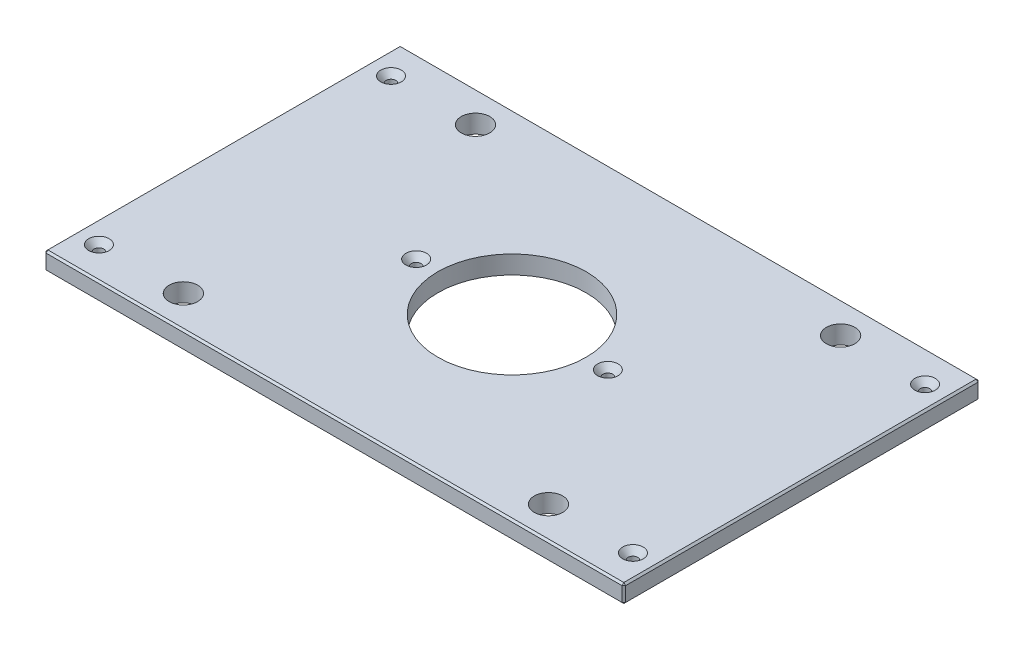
ISO-10303-21;
HEADER;
FILE_DESCRIPTION(('STEP AP214'),'2;1');
FILE_NAME('part.step','',(''),(''),'','','');
FILE_SCHEMA(('AUTOMOTIVE_DESIGN { 1 0 10303 214 1 1 1 1 }'));
ENDSEC;
DATA;
#1=APPLICATION_CONTEXT('core data for automotive mechanical design processes');
#2=APPLICATION_PROTOCOL_DEFINITION('international standard','automotive_design',2000,#1);
#3=PRODUCT_CONTEXT('',#1,'mechanical');
#4=PRODUCT('Part','Part','',(#3));
#5=PRODUCT_RELATED_PRODUCT_CATEGORY('part','',(#4));
#6=PRODUCT_DEFINITION_FORMATION('','',#4);
#7=PRODUCT_DEFINITION_CONTEXT('part definition',#1,'design');
#8=PRODUCT_DEFINITION('design','',#6,#7);
#9=PRODUCT_DEFINITION_SHAPE('','',#8);
#10=(LENGTH_UNIT() NAMED_UNIT(*) SI_UNIT(.MILLI.,.METRE.));
#11=(NAMED_UNIT(*) PLANE_ANGLE_UNIT() SI_UNIT($,.RADIAN.));
#12=(NAMED_UNIT(*) SI_UNIT($,.STERADIAN.) SOLID_ANGLE_UNIT());
#13=UNCERTAINTY_MEASURE_WITH_UNIT(LENGTH_MEASURE(1.E-05),#10,'distance_accuracy_value','');
#14=(GEOMETRIC_REPRESENTATION_CONTEXT(3) GLOBAL_UNCERTAINTY_ASSIGNED_CONTEXT((#13)) GLOBAL_UNIT_ASSIGNED_CONTEXT((#10,
#11,#12)) REPRESENTATION_CONTEXT('',''));
#15=CARTESIAN_POINT('',(0.,0.,0.));
#16=DIRECTION('',(0.,0.,1.));
#17=DIRECTION('',(1.,0.,0.));
#18=AXIS2_PLACEMENT_3D('',#15,#16,#17);
#19=CARTESIAN_POINT('',(-201.6125,12.7,-123.825));
#20=DIRECTION('',(1.,0.,0.));
#21=DIRECTION('',(0.,0.,-1.));
#22=AXIS2_PLACEMENT_3D('',#19,#20,#21);
#23=PLANE('',#22);
#24=DIRECTION('',(0.,0.,-1.));
#25=VECTOR('',#24,1.);
#26=CARTESIAN_POINT('',(-201.6125,11.4300000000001,-123.825));
#27=LINE('',#26,#25);
#28=CARTESIAN_POINT('',(-201.6125,11.4300000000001,122.555));
#29=VERTEX_POINT('',#28);
#30=CARTESIAN_POINT('',(-201.6125,11.4300000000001,-122.555));
#31=VERTEX_POINT('',#30);
#32=EDGE_CURVE('E136',#29,#31,#27,.T.);
#33=ORIENTED_EDGE('',*,*,#32,.T.);
#34=DIRECTION('',(0.,-1.,0.));
#35=VECTOR('',#34,1.);
#36=CARTESIAN_POINT('',(-201.6125,12.7,-122.555));
#37=LINE('',#36,#35);
#38=CARTESIAN_POINT('',(-201.6125,1.26999999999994,-122.555));
#39=VERTEX_POINT('',#38);
#40=EDGE_CURVE('E132',#31,#39,#37,.T.);
#41=ORIENTED_EDGE('',*,*,#40,.T.);
#42=DIRECTION('',(0.,0.,1.));
#43=VECTOR('',#42,1.);
#44=CARTESIAN_POINT('',(-201.6125,1.26999999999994,-123.825));
#45=LINE('',#44,#43);
#46=CARTESIAN_POINT('',(-201.6125,1.26999999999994,122.555));
#47=VERTEX_POINT('',#46);
#48=EDGE_CURVE('E127',#39,#47,#45,.T.);
#49=ORIENTED_EDGE('',*,*,#48,.T.);
#50=DIRECTION('',(0.,1.,0.));
#51=VECTOR('',#50,1.);
#52=CARTESIAN_POINT('',(-201.6125,12.7,122.555));
#53=LINE('',#52,#51);
#54=EDGE_CURVE('E129',#47,#29,#53,.T.);
#55=ORIENTED_EDGE('',*,*,#54,.T.);
#56=EDGE_LOOP('',(#33,#41,#49,#55));
#57=FACE_BOUND('',#56,.T.);
#58=ADVANCED_FACE('F36',(#57),#23,.F.);
#59=CARTESIAN_POINT('',(-201.6125,12.7,123.825));
#60=DIRECTION('',(0.,0.,-1.));
#61=DIRECTION('',(-1.,0.,0.));
#62=AXIS2_PLACEMENT_3D('',#59,#60,#61);
#63=PLANE('',#62);
#64=DIRECTION('',(1.,0.,0.));
#65=VECTOR('',#64,1.);
#66=CARTESIAN_POINT('',(-201.6125,1.26999999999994,123.825));
#67=LINE('',#66,#65);
#68=CARTESIAN_POINT('',(-200.3425,1.26999999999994,123.825));
#69=VERTEX_POINT('',#68);
#70=CARTESIAN_POINT('',(200.3425,1.26999999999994,123.825));
#71=VERTEX_POINT('',#70);
#72=EDGE_CURVE('E59',#69,#71,#67,.T.);
#73=ORIENTED_EDGE('',*,*,#72,.T.);
#74=DIRECTION('',(0.,1.,0.));
#75=VECTOR('',#74,1.);
#76=CARTESIAN_POINT('',(200.3425,12.7,123.825));
#77=LINE('',#76,#75);
#78=CARTESIAN_POINT('',(200.3425,11.4300000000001,123.825));
#79=VERTEX_POINT('',#78);
#80=EDGE_CURVE('E11',#71,#79,#77,.T.);
#81=ORIENTED_EDGE('',*,*,#80,.T.);
#82=DIRECTION('',(-1.,0.,0.));
#83=VECTOR('',#82,1.);
#84=CARTESIAN_POINT('',(-201.6125,11.4300000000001,123.825));
#85=LINE('',#84,#83);
#86=CARTESIAN_POINT('',(-200.3425,11.4300000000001,123.825));
#87=VERTEX_POINT('',#86);
#88=EDGE_CURVE('E45',#79,#87,#85,.T.);
#89=ORIENTED_EDGE('',*,*,#88,.T.);
#90=DIRECTION('',(0.,-1.,0.));
#91=VECTOR('',#90,1.);
#92=CARTESIAN_POINT('',(-200.3425,12.7,123.825));
#93=LINE('',#92,#91);
#94=EDGE_CURVE('E280',#87,#69,#93,.T.);
#95=ORIENTED_EDGE('',*,*,#94,.T.);
#96=EDGE_LOOP('',(#73,#81,#89,#95));
#97=FACE_BOUND('',#96,.T.);
#98=ADVANCED_FACE('F349',(#97),#63,.F.);
#99=CARTESIAN_POINT('',(201.6125,12.7,-123.825));
#100=DIRECTION('',(-1.,0.,0.));
#101=DIRECTION('',(0.,0.,1.));
#102=AXIS2_PLACEMENT_3D('',#99,#100,#101);
#103=PLANE('',#102);
#104=DIRECTION('',(0.,0.,-1.));
#105=VECTOR('',#104,1.);
#106=CARTESIAN_POINT('',(201.6125,1.26999999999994,-123.825));
#107=LINE('',#106,#105);
#108=CARTESIAN_POINT('',(201.6125,1.26999999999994,122.555));
#109=VERTEX_POINT('',#108);
#110=CARTESIAN_POINT('',(201.6125,1.26999999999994,-122.555));
#111=VERTEX_POINT('',#110);
#112=EDGE_CURVE('E275',#109,#111,#107,.T.);
#113=ORIENTED_EDGE('',*,*,#112,.T.);
#114=DIRECTION('',(0.,1.,0.));
#115=VECTOR('',#114,1.);
#116=CARTESIAN_POINT('',(201.6125,12.7,-122.555));
#117=LINE('',#116,#115);
#118=CARTESIAN_POINT('',(201.6125,11.4300000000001,-122.555));
#119=VERTEX_POINT('',#118);
#120=EDGE_CURVE('E277',#111,#119,#117,.T.);
#121=ORIENTED_EDGE('',*,*,#120,.T.);
#122=DIRECTION('',(0.,0.,1.));
#123=VECTOR('',#122,1.);
#124=CARTESIAN_POINT('',(201.6125,11.4300000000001,123.825));
#125=LINE('',#124,#123);
#126=CARTESIAN_POINT('',(201.6125,11.4300000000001,122.555));
#127=VERTEX_POINT('',#126);
#128=EDGE_CURVE('E273',#119,#127,#125,.T.);
#129=ORIENTED_EDGE('',*,*,#128,.T.);
#130=DIRECTION('',(0.,-1.,0.));
#131=VECTOR('',#130,1.);
#132=CARTESIAN_POINT('',(201.6125,12.7,122.555));
#133=LINE('',#132,#131);
#134=EDGE_CURVE('E271',#127,#109,#133,.T.);
#135=ORIENTED_EDGE('',*,*,#134,.T.);
#136=EDGE_LOOP('',(#113,#121,#129,#135));
#137=FACE_BOUND('',#136,.T.);
#138=ADVANCED_FACE('F336',(#137),#103,.F.);
#139=CARTESIAN_POINT('',(-201.6125,12.7,-123.825));
#140=DIRECTION('',(0.,0.,1.));
#141=DIRECTION('',(1.,0.,0.));
#142=AXIS2_PLACEMENT_3D('',#139,#140,#141);
#143=PLANE('',#142);
#144=DIRECTION('',(-1.,0.,0.));
#145=VECTOR('',#144,1.);
#146=CARTESIAN_POINT('',(-201.6125,1.26999999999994,-123.825));
#147=LINE('',#146,#145);
#148=CARTESIAN_POINT('',(200.3425,1.26999999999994,-123.825));
#149=VERTEX_POINT('',#148);
#150=CARTESIAN_POINT('',(-200.3425,1.26999999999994,-123.825));
#151=VERTEX_POINT('',#150);
#152=EDGE_CURVE('E247',#149,#151,#147,.T.);
#153=ORIENTED_EDGE('',*,*,#152,.T.);
#154=DIRECTION('',(0.,1.,0.));
#155=VECTOR('',#154,1.);
#156=CARTESIAN_POINT('',(-200.3425,12.7,-123.825));
#157=LINE('',#156,#155);
#158=CARTESIAN_POINT('',(-200.3425,11.4300000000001,-123.825));
#159=VERTEX_POINT('',#158);
#160=EDGE_CURVE('E251',#151,#159,#157,.T.);
#161=ORIENTED_EDGE('',*,*,#160,.T.);
#162=DIRECTION('',(1.,0.,0.));
#163=VECTOR('',#162,1.);
#164=CARTESIAN_POINT('',(201.6125,11.4300000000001,-123.825));
#165=LINE('',#164,#163);
#166=CARTESIAN_POINT('',(200.3425,11.4300000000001,-123.825));
#167=VERTEX_POINT('',#166);
#168=EDGE_CURVE('E249',#159,#167,#165,.T.);
#169=ORIENTED_EDGE('',*,*,#168,.T.);
#170=DIRECTION('',(0.,-1.,0.));
#171=VECTOR('',#170,1.);
#172=CARTESIAN_POINT('',(200.3425,12.7,-123.825));
#173=LINE('',#172,#171);
#174=EDGE_CURVE('E245',#167,#149,#173,.T.);
#175=ORIENTED_EDGE('',*,*,#174,.T.);
#176=EDGE_LOOP('',(#153,#161,#169,#175));
#177=FACE_BOUND('',#176,.T.);
#178=ADVANCED_FACE('F310',(#177),#143,.F.);
#179=CARTESIAN_POINT('',(0.,12.7,0.));
#180=DIRECTION('',(0.,1.,0.));
#181=DIRECTION('',(0.,0.,1.));
#182=AXIS2_PLACEMENT_3D('',#179,#180,#181);
#183=PLANE('',#182);
#184=CARTESIAN_POINT('',(185.7375,12.7,-101.6));
#185=DIRECTION('',(0.,1.,0.));
#186=DIRECTION('',(0.,0.,1.));
#187=AXIS2_PLACEMENT_3D('',#184,#185,#186);
#188=CIRCLE('',#187,7.13739999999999);
#189=CARTESIAN_POINT('',(185.7375,12.7,-94.4626));
#190=VERTEX_POINT('',#189);
#191=EDGE_CURVE('E753',#190,#190,#188,.T.);
#192=ORIENTED_EDGE('',*,*,#191,.F.);
#193=EDGE_LOOP('',(#192));
#194=FACE_BOUND('',#193,.T.);
#195=CARTESIAN_POINT('',(185.7375,12.7,101.6));
#196=DIRECTION('',(0.,1.,0.));
#197=DIRECTION('',(0.,0.,1.));
#198=AXIS2_PLACEMENT_3D('',#195,#196,#197);
#199=CIRCLE('',#198,7.13739999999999);
#200=CARTESIAN_POINT('',(185.7375,12.7,108.7374));
#201=VERTEX_POINT('',#200);
#202=EDGE_CURVE('E757',#201,#201,#199,.T.);
#203=ORIENTED_EDGE('',*,*,#202,.F.);
#204=EDGE_LOOP('',(#203));
#205=FACE_BOUND('',#204,.T.);
#206=CARTESIAN_POINT('',(-185.7375,12.7,101.6));
#207=DIRECTION('',(0.,1.,0.));
#208=DIRECTION('',(0.,0.,1.));
#209=AXIS2_PLACEMENT_3D('',#206,#207,#208);
#210=CIRCLE('',#209,7.13739999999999);
#211=CARTESIAN_POINT('',(-185.7375,12.7,108.7374));
#212=VERTEX_POINT('',#211);
#213=EDGE_CURVE('E761',#212,#212,#210,.T.);
#214=ORIENTED_EDGE('',*,*,#213,.F.);
#215=EDGE_LOOP('',(#214));
#216=FACE_BOUND('',#215,.T.);
#217=CARTESIAN_POINT('',(-66.675,12.7,0.));
#218=DIRECTION('',(0.,1.,0.));
#219=DIRECTION('',(0.,0.,1.));
#220=AXIS2_PLACEMENT_3D('',#217,#218,#219);
#221=CIRCLE('',#220,7.1374);
#222=CARTESIAN_POINT('',(-66.675,12.7,7.1374));
#223=VERTEX_POINT('',#222);
#224=EDGE_CURVE('E765',#223,#223,#221,.T.);
#225=ORIENTED_EDGE('',*,*,#224,.F.);
#226=EDGE_LOOP('',(#225));
#227=FACE_BOUND('',#226,.T.);
#228=CARTESIAN_POINT('',(66.675,12.7,0.));
#229=DIRECTION('',(0.,1.,0.));
#230=DIRECTION('',(0.,0.,1.));
#231=AXIS2_PLACEMENT_3D('',#228,#229,#230);
#232=CIRCLE('',#231,7.1374);
#233=CARTESIAN_POINT('',(66.675,12.7,7.1374));
#234=VERTEX_POINT('',#233);
#235=EDGE_CURVE('E769',#234,#234,#232,.T.);
#236=ORIENTED_EDGE('',*,*,#235,.F.);
#237=EDGE_LOOP('',(#236));
#238=FACE_BOUND('',#237,.T.);
#239=CARTESIAN_POINT('',(-185.7375,12.7,-101.6));
#240=DIRECTION('',(0.,1.,0.));
#241=DIRECTION('',(0.,0.,1.));
#242=AXIS2_PLACEMENT_3D('',#239,#240,#241);
#243=CIRCLE('',#242,7.13739999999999);
#244=CARTESIAN_POINT('',(-185.7375,12.7,-94.4626));
#245=VERTEX_POINT('',#244);
#246=EDGE_CURVE('E772',#245,#245,#243,.T.);
#247=ORIENTED_EDGE('',*,*,#246,.F.);
#248=EDGE_LOOP('',(#247));
#249=FACE_BOUND('',#248,.T.);
#250=DIRECTION('',(0.,0.,-1.));
#251=VECTOR('',#250,1.);
#252=CARTESIAN_POINT('',(200.3425,12.7,-123.825));
#253=LINE('',#252,#251);
#254=CARTESIAN_POINT('',(200.3425,12.7,122.555));
#255=VERTEX_POINT('',#254);
#256=CARTESIAN_POINT('',(200.3425,12.7,-122.555));
#257=VERTEX_POINT('',#256);
#258=EDGE_CURVE('E258',#255,#257,#253,.T.);
#259=ORIENTED_EDGE('',*,*,#258,.T.);
#260=DIRECTION('',(-1.,0.,0.));
#261=VECTOR('',#260,1.);
#262=CARTESIAN_POINT('',(-201.6125,12.7,-122.555));
#263=LINE('',#262,#261);
#264=CARTESIAN_POINT('',(-200.3425,12.7,-122.555));
#265=VERTEX_POINT('',#264);
#266=EDGE_CURVE('E260',#257,#265,#263,.T.);
#267=ORIENTED_EDGE('',*,*,#266,.T.);
#268=DIRECTION('',(0.,0.,1.));
#269=VECTOR('',#268,1.);
#270=CARTESIAN_POINT('',(-200.3425,12.7,123.825));
#271=LINE('',#270,#269);
#272=CARTESIAN_POINT('',(-200.3425,12.7,122.555));
#273=VERTEX_POINT('',#272);
#274=EDGE_CURVE('E256',#265,#273,#271,.T.);
#275=ORIENTED_EDGE('',*,*,#274,.T.);
#276=DIRECTION('',(1.,0.,0.));
#277=VECTOR('',#276,1.);
#278=CARTESIAN_POINT('',(201.6125,12.7,122.555));
#279=LINE('',#278,#277);
#280=EDGE_CURVE('E254',#273,#255,#279,.T.);
#281=ORIENTED_EDGE('',*,*,#280,.T.);
#282=EDGE_LOOP('',(#259,#267,#275,#281));
#283=FACE_BOUND('',#282,.T.);
#284=CARTESIAN_POINT('',(127.,12.7,-101.6));
#285=DIRECTION('',(0.,1.,0.));
#286=DIRECTION('',(0.,0.,1.));
#287=AXIS2_PLACEMENT_3D('',#284,#285,#286);
#288=CIRCLE('',#287,9.921875);
#289=CARTESIAN_POINT('',(127.,12.7,-91.678125));
#290=VERTEX_POINT('',#289);
#291=EDGE_CURVE('E205',#290,#290,#288,.T.);
#292=ORIENTED_EDGE('',*,*,#291,.F.);
#293=EDGE_LOOP('',(#292));
#294=FACE_BOUND('',#293,.T.);
#295=CARTESIAN_POINT('',(-127.,12.7,-101.6));
#296=DIRECTION('',(0.,1.,0.));
#297=DIRECTION('',(0.,0.,1.));
#298=AXIS2_PLACEMENT_3D('',#295,#296,#297);
#299=CIRCLE('',#298,9.921875);
#300=CARTESIAN_POINT('',(-127.,12.7,-91.678125));
#301=VERTEX_POINT('',#300);
#302=EDGE_CURVE('E215',#301,#301,#299,.T.);
#303=ORIENTED_EDGE('',*,*,#302,.F.);
#304=EDGE_LOOP('',(#303));
#305=FACE_BOUND('',#304,.T.);
#306=CARTESIAN_POINT('',(127.,12.7,101.6));
#307=DIRECTION('',(0.,1.,0.));
#308=DIRECTION('',(0.,0.,1.));
#309=AXIS2_PLACEMENT_3D('',#306,#307,#308);
#310=CIRCLE('',#309,9.921875);
#311=CARTESIAN_POINT('',(127.,12.7,111.521875));
#312=VERTEX_POINT('',#311);
#313=EDGE_CURVE('E226',#312,#312,#310,.T.);
#314=ORIENTED_EDGE('',*,*,#313,.F.);
#315=EDGE_LOOP('',(#314));
#316=FACE_BOUND('',#315,.T.);
#317=CARTESIAN_POINT('',(-127.,12.7,101.6));
#318=DIRECTION('',(0.,1.,0.));
#319=DIRECTION('',(0.,0.,1.));
#320=AXIS2_PLACEMENT_3D('',#317,#318,#319);
#321=CIRCLE('',#320,9.921875);
#322=CARTESIAN_POINT('',(-127.,12.7,111.521875));
#323=VERTEX_POINT('',#322);
#324=EDGE_CURVE('E232',#323,#323,#321,.T.);
#325=ORIENTED_EDGE('',*,*,#324,.F.);
#326=EDGE_LOOP('',(#325));
#327=FACE_BOUND('',#326,.T.);
#328=CARTESIAN_POINT('',(0.,12.7,0.));
#329=DIRECTION('',(0.,1.,0.));
#330=DIRECTION('',(0.,0.,1.));
#331=AXIS2_PLACEMENT_3D('',#328,#329,#330);
#332=CIRCLE('',#331,51.562);
#333=CARTESIAN_POINT('',(0.,12.7,51.562));
#334=VERTEX_POINT('',#333);
#335=EDGE_CURVE('E238',#334,#334,#332,.T.);
#336=ORIENTED_EDGE('',*,*,#335,.F.);
#337=EDGE_LOOP('',(#336));
#338=FACE_BOUND('',#337,.T.);
#339=ADVANCED_FACE('F358',(#194,#205,#216,#227,#238,#249,#283,#294,#305,#316,#327,#338),#183,.T.);
#340=CARTESIAN_POINT('',(0.,0.,0.));
#341=DIRECTION('',(0.,1.,0.));
#342=DIRECTION('',(0.,0.,1.));
#343=AXIS2_PLACEMENT_3D('',#340,#341,#342);
#344=PLANE('',#343);
#345=CARTESIAN_POINT('',(185.7375,0.,-101.6));
#346=DIRECTION('',(0.,1.,0.));
#347=DIRECTION('',(0.,0.,1.));
#348=AXIS2_PLACEMENT_3D('',#345,#346,#347);
#349=CIRCLE('',#348,3.3782);
#350=CARTESIAN_POINT('',(185.7375,0.,-98.2218));
#351=VERTEX_POINT('',#350);
#352=EDGE_CURVE('E806',#351,#351,#349,.T.);
#353=ORIENTED_EDGE('',*,*,#352,.T.);
#354=EDGE_LOOP('',(#353));
#355=FACE_BOUND('',#354,.T.);
#356=CARTESIAN_POINT('',(185.7375,0.,101.6));
#357=DIRECTION('',(0.,1.,0.));
#358=DIRECTION('',(0.,0.,1.));
#359=AXIS2_PLACEMENT_3D('',#356,#357,#358);
#360=CIRCLE('',#359,3.3782);
#361=CARTESIAN_POINT('',(185.7375,0.,104.9782));
#362=VERTEX_POINT('',#361);
#363=EDGE_CURVE('E799',#362,#362,#360,.T.);
#364=ORIENTED_EDGE('',*,*,#363,.T.);
#365=EDGE_LOOP('',(#364));
#366=FACE_BOUND('',#365,.T.);
#367=CARTESIAN_POINT('',(-185.7375,0.,101.6));
#368=DIRECTION('',(0.,1.,0.));
#369=DIRECTION('',(0.,0.,1.));
#370=AXIS2_PLACEMENT_3D('',#367,#368,#369);
#371=CIRCLE('',#370,3.3782);
#372=CARTESIAN_POINT('',(-185.7375,0.,104.9782));
#373=VERTEX_POINT('',#372);
#374=EDGE_CURVE('E792',#373,#373,#371,.T.);
#375=ORIENTED_EDGE('',*,*,#374,.T.);
#376=EDGE_LOOP('',(#375));
#377=FACE_BOUND('',#376,.T.);
#378=CARTESIAN_POINT('',(-66.675,0.,0.));
#379=DIRECTION('',(0.,1.,0.));
#380=DIRECTION('',(0.,0.,1.));
#381=AXIS2_PLACEMENT_3D('',#378,#379,#380);
#382=CIRCLE('',#381,3.3782);
#383=CARTESIAN_POINT('',(-66.675,0.,3.3782));
#384=VERTEX_POINT('',#383);
#385=EDGE_CURVE('E785',#384,#384,#382,.T.);
#386=ORIENTED_EDGE('',*,*,#385,.T.);
#387=EDGE_LOOP('',(#386));
#388=FACE_BOUND('',#387,.T.);
#389=CARTESIAN_POINT('',(66.675,0.,0.));
#390=DIRECTION('',(0.,1.,0.));
#391=DIRECTION('',(0.,0.,1.));
#392=AXIS2_PLACEMENT_3D('',#389,#390,#391);
#393=CIRCLE('',#392,3.3782);
#394=CARTESIAN_POINT('',(66.675,0.,3.3782));
#395=VERTEX_POINT('',#394);
#396=EDGE_CURVE('E775',#395,#395,#393,.T.);
#397=ORIENTED_EDGE('',*,*,#396,.T.);
#398=EDGE_LOOP('',(#397));
#399=FACE_BOUND('',#398,.T.);
#400=CARTESIAN_POINT('',(-185.7375,0.,-101.6));
#401=DIRECTION('',(0.,1.,0.));
#402=DIRECTION('',(0.,0.,1.));
#403=AXIS2_PLACEMENT_3D('',#400,#401,#402);
#404=CIRCLE('',#403,3.3782);
#405=CARTESIAN_POINT('',(-185.7375,0.,-98.2218));
#406=VERTEX_POINT('',#405);
#407=EDGE_CURVE('E218',#406,#406,#404,.T.);
#408=ORIENTED_EDGE('',*,*,#407,.T.);
#409=EDGE_LOOP('',(#408));
#410=FACE_BOUND('',#409,.T.);
#411=DIRECTION('',(0.,0.,-1.));
#412=VECTOR('',#411,1.);
#413=CARTESIAN_POINT('',(-200.3425,0.,0.));
#414=LINE('',#413,#412);
#415=CARTESIAN_POINT('',(-200.3425,0.,122.555));
#416=VERTEX_POINT('',#415);
#417=CARTESIAN_POINT('',(-200.3425,0.,-122.555));
#418=VERTEX_POINT('',#417);
#419=EDGE_CURVE('E159',#416,#418,#414,.T.);
#420=ORIENTED_EDGE('',*,*,#419,.T.);
#421=DIRECTION('',(1.,0.,0.));
#422=VECTOR('',#421,1.);
#423=CARTESIAN_POINT('',(0.,0.,-122.555));
#424=LINE('',#423,#422);
#425=CARTESIAN_POINT('',(200.3425,0.,-122.555));
#426=VERTEX_POINT('',#425);
#427=EDGE_CURVE('E268',#418,#426,#424,.T.);
#428=ORIENTED_EDGE('',*,*,#427,.T.);
#429=DIRECTION('',(0.,0.,1.));
#430=VECTOR('',#429,1.);
#431=CARTESIAN_POINT('',(200.3425,0.,0.));
#432=LINE('',#431,#430);
#433=CARTESIAN_POINT('',(200.3425,0.,122.555));
#434=VERTEX_POINT('',#433);
#435=EDGE_CURVE('E266',#426,#434,#432,.T.);
#436=ORIENTED_EDGE('',*,*,#435,.T.);
#437=DIRECTION('',(-1.,0.,0.));
#438=VECTOR('',#437,1.);
#439=CARTESIAN_POINT('',(0.,0.,122.555));
#440=LINE('',#439,#438);
#441=EDGE_CURVE('E263',#434,#416,#440,.T.);
#442=ORIENTED_EDGE('',*,*,#441,.T.);
#443=EDGE_LOOP('',(#420,#428,#436,#442));
#444=FACE_BOUND('',#443,.T.);
#445=CARTESIAN_POINT('',(127.,0.,-101.6));
#446=DIRECTION('',(0.,1.,0.));
#447=DIRECTION('',(0.,0.,1.));
#448=AXIS2_PLACEMENT_3D('',#445,#446,#447);
#449=CIRCLE('',#448,9.921875);
#450=CARTESIAN_POINT('',(127.,0.,-91.678125));
#451=VERTEX_POINT('',#450);
#452=EDGE_CURVE('E210',#451,#451,#449,.T.);
#453=ORIENTED_EDGE('',*,*,#452,.T.);
#454=EDGE_LOOP('',(#453));
#455=FACE_BOUND('',#454,.T.);
#456=CARTESIAN_POINT('',(-127.,0.,-101.6));
#457=DIRECTION('',(0.,1.,0.));
#458=DIRECTION('',(0.,0.,1.));
#459=AXIS2_PLACEMENT_3D('',#456,#457,#458);
#460=CIRCLE('',#459,9.921875);
#461=CARTESIAN_POINT('',(-127.,0.,-91.678125));
#462=VERTEX_POINT('',#461);
#463=EDGE_CURVE('E223',#462,#462,#460,.T.);
#464=ORIENTED_EDGE('',*,*,#463,.T.);
#465=EDGE_LOOP('',(#464));
#466=FACE_BOUND('',#465,.T.);
#467=CARTESIAN_POINT('',(127.,0.,101.6));
#468=DIRECTION('',(0.,1.,0.));
#469=DIRECTION('',(0.,0.,1.));
#470=AXIS2_PLACEMENT_3D('',#467,#468,#469);
#471=CIRCLE('',#470,9.921875);
#472=CARTESIAN_POINT('',(127.,0.,111.521875));
#473=VERTEX_POINT('',#472);
#474=EDGE_CURVE('E229',#473,#473,#471,.T.);
#475=ORIENTED_EDGE('',*,*,#474,.T.);
#476=EDGE_LOOP('',(#475));
#477=FACE_BOUND('',#476,.T.);
#478=CARTESIAN_POINT('',(-127.,0.,101.6));
#479=DIRECTION('',(0.,1.,0.));
#480=DIRECTION('',(0.,0.,1.));
#481=AXIS2_PLACEMENT_3D('',#478,#479,#480);
#482=CIRCLE('',#481,9.921875);
#483=CARTESIAN_POINT('',(-127.,0.,111.521875));
#484=VERTEX_POINT('',#483);
#485=EDGE_CURVE('E235',#484,#484,#482,.T.);
#486=ORIENTED_EDGE('',*,*,#485,.T.);
#487=EDGE_LOOP('',(#486));
#488=FACE_BOUND('',#487,.T.);
#489=CARTESIAN_POINT('',(0.,0.,0.));
#490=DIRECTION('',(0.,1.,0.));
#491=DIRECTION('',(0.,0.,1.));
#492=AXIS2_PLACEMENT_3D('',#489,#490,#491);
#493=CIRCLE('',#492,51.562);
#494=CARTESIAN_POINT('',(0.,0.,51.562));
#495=VERTEX_POINT('',#494);
#496=EDGE_CURVE('E148',#495,#495,#493,.T.);
#497=ORIENTED_EDGE('',*,*,#496,.T.);
#498=EDGE_LOOP('',(#497));
#499=FACE_BOUND('',#498,.T.);
#500=ADVANCED_FACE('F323',(#355,#366,#377,#388,#399,#410,#444,#455,#466,#477,#488,#499),#344,.F.);
#501=CARTESIAN_POINT('',(0.,0.,0.));
#502=DIRECTION('',(0.,1.,0.));
#503=DIRECTION('',(0.,0.,1.));
#504=AXIS2_PLACEMENT_3D('',#501,#502,#503);
#505=CYLINDRICAL_SURFACE('',#504,51.562);
#506=ORIENTED_EDGE('',*,*,#496,.F.);
#507=EDGE_LOOP('',(#506));
#508=FACE_BOUND('',#507,.T.);
#509=ORIENTED_EDGE('',*,*,#335,.T.);
#510=EDGE_LOOP('',(#509));
#511=FACE_BOUND('',#510,.T.);
#512=ADVANCED_FACE('F692',(#508,#511),#505,.F.);
#513=CARTESIAN_POINT('',(-127.,12.7,101.6));
#514=DIRECTION('',(0.,1.,0.));
#515=DIRECTION('',(0.,0.,1.));
#516=AXIS2_PLACEMENT_3D('',#513,#514,#515);
#517=CYLINDRICAL_SURFACE('',#516,9.921875);
#518=ORIENTED_EDGE('',*,*,#485,.F.);
#519=EDGE_LOOP('',(#518));
#520=FACE_BOUND('',#519,.T.);
#521=ORIENTED_EDGE('',*,*,#324,.T.);
#522=EDGE_LOOP('',(#521));
#523=FACE_BOUND('',#522,.T.);
#524=ADVANCED_FACE('F683',(#520,#523),#517,.F.);
#525=CARTESIAN_POINT('',(127.,12.7,101.6));
#526=DIRECTION('',(0.,1.,0.));
#527=DIRECTION('',(0.,0.,1.));
#528=AXIS2_PLACEMENT_3D('',#525,#526,#527);
#529=CYLINDRICAL_SURFACE('',#528,9.921875);
#530=ORIENTED_EDGE('',*,*,#474,.F.);
#531=EDGE_LOOP('',(#530));
#532=FACE_BOUND('',#531,.T.);
#533=ORIENTED_EDGE('',*,*,#313,.T.);
#534=EDGE_LOOP('',(#533));
#535=FACE_BOUND('',#534,.T.);
#536=ADVANCED_FACE('F674',(#532,#535),#529,.F.);
#537=CARTESIAN_POINT('',(-127.,12.7,-101.6));
#538=DIRECTION('',(0.,1.,0.));
#539=DIRECTION('',(0.,0.,1.));
#540=AXIS2_PLACEMENT_3D('',#537,#538,#539);
#541=CYLINDRICAL_SURFACE('',#540,9.921875);
#542=ORIENTED_EDGE('',*,*,#463,.F.);
#543=EDGE_LOOP('',(#542));
#544=FACE_BOUND('',#543,.T.);
#545=ORIENTED_EDGE('',*,*,#302,.T.);
#546=EDGE_LOOP('',(#545));
#547=FACE_BOUND('',#546,.T.);
#548=ADVANCED_FACE('F664',(#544,#547),#541,.F.);
#549=CARTESIAN_POINT('',(127.,12.7,-101.6));
#550=DIRECTION('',(0.,1.,0.));
#551=DIRECTION('',(0.,0.,1.));
#552=AXIS2_PLACEMENT_3D('',#549,#550,#551);
#553=CYLINDRICAL_SURFACE('',#552,9.921875);
#554=ORIENTED_EDGE('',*,*,#452,.F.);
#555=EDGE_LOOP('',(#554));
#556=FACE_BOUND('',#555,.T.);
#557=ORIENTED_EDGE('',*,*,#291,.T.);
#558=EDGE_LOOP('',(#557));
#559=FACE_BOUND('',#558,.T.);
#560=ADVANCED_FACE('F367',(#556,#559),#553,.F.);
#561=CARTESIAN_POINT('',(201.6125,12.7,122.555));
#562=DIRECTION('',(-0.707106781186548,0.,-0.707106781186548));
#563=DIRECTION('',(0.,-1.,0.));
#564=AXIS2_PLACEMENT_3D('',#561,#562,#563);
#565=PLANE('',#564);
#566=DIRECTION('',(-0.707106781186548,0.,0.707106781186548));
#567=VECTOR('',#566,1.);
#568=CARTESIAN_POINT('',(201.6125,11.4300000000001,122.555));
#569=LINE('',#568,#567);
#570=EDGE_CURVE('E40',#79,#127,#569,.F.);
#571=ORIENTED_EDGE('',*,*,#570,.F.);
#572=ORIENTED_EDGE('',*,*,#80,.F.);
#573=DIRECTION('',(0.707106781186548,0.,-0.707106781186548));
#574=VECTOR('',#573,1.);
#575=CARTESIAN_POINT('',(200.9775,1.26999999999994,123.19));
#576=LINE('',#575,#574);
#577=EDGE_CURVE('E198',#109,#71,#576,.F.);
#578=ORIENTED_EDGE('',*,*,#577,.F.);
#579=ORIENTED_EDGE('',*,*,#134,.F.);
#580=EDGE_LOOP('',(#571,#572,#578,#579));
#581=FACE_BOUND('',#580,.T.);
#582=ADVANCED_FACE('F38',(#581),#565,.F.);
#583=CARTESIAN_POINT('',(201.6125,11.4300000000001,122.555));
#584=DIRECTION('',(0.577350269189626,0.577350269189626,0.577350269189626));
#585=DIRECTION('',(0.707106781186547,0.,-0.707106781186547));
#586=AXIS2_PLACEMENT_3D('',#583,#584,#585);
#587=PLANE('',#586);
#588=DIRECTION('',(0.,-0.707106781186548,0.707106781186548));
#589=VECTOR('',#588,1.);
#590=CARTESIAN_POINT('',(200.3425,12.065,123.19));
#591=LINE('',#590,#589);
#592=EDGE_CURVE('E194',#79,#255,#591,.F.);
#593=ORIENTED_EDGE('',*,*,#592,.F.);
#594=ORIENTED_EDGE('',*,*,#570,.T.);
#595=DIRECTION('',(-0.707106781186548,0.707106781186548,0.));
#596=VECTOR('',#595,1.);
#597=CARTESIAN_POINT('',(201.6125,11.4300000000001,122.555));
#598=LINE('',#597,#596);
#599=EDGE_CURVE('E196',#255,#127,#598,.F.);
#600=ORIENTED_EDGE('',*,*,#599,.F.);
#601=EDGE_LOOP('',(#593,#594,#600));
#602=FACE_BOUND('',#601,.T.);
#603=ADVANCED_FACE('F360',(#602),#587,.T.);
#604=CARTESIAN_POINT('',(200.3425,0.,122.555));
#605=DIRECTION('',(0.577350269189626,-0.577350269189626,0.577350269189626));
#606=DIRECTION('',(0.707106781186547,0.,-0.707106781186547));
#607=AXIS2_PLACEMENT_3D('',#604,#605,#606);
#608=PLANE('',#607);
#609=DIRECTION('',(-0.707106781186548,-0.707106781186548,0.));
#610=VECTOR('',#609,1.);
#611=CARTESIAN_POINT('',(200.3425,0.,122.555));
#612=LINE('',#611,#610);
#613=EDGE_CURVE('E188',#109,#434,#612,.T.);
#614=ORIENTED_EDGE('',*,*,#613,.F.);
#615=ORIENTED_EDGE('',*,*,#577,.T.);
#616=DIRECTION('',(0.,0.707106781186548,0.707106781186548));
#617=VECTOR('',#616,1.);
#618=CARTESIAN_POINT('',(200.3425,0.,122.555));
#619=LINE('',#618,#617);
#620=EDGE_CURVE('E191',#434,#71,#619,.T.);
#621=ORIENTED_EDGE('',*,*,#620,.F.);
#622=EDGE_LOOP('',(#614,#615,#621));
#623=FACE_BOUND('',#622,.T.);
#624=ADVANCED_FACE('F329',(#623),#608,.T.);
#625=CARTESIAN_POINT('',(200.3425,12.7,0.));
#626=DIRECTION('',(0.707106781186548,0.707106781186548,0.));
#627=DIRECTION('',(0.,0.,1.));
#628=AXIS2_PLACEMENT_3D('',#625,#626,#627);
#629=PLANE('',#628);
#630=ORIENTED_EDGE('',*,*,#599,.T.);
#631=ORIENTED_EDGE('',*,*,#128,.F.);
#632=DIRECTION('',(0.707106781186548,-0.707106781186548,0.));
#633=VECTOR('',#632,1.);
#634=CARTESIAN_POINT('',(200.9775,12.065,-122.555));
#635=LINE('',#634,#633);
#636=EDGE_CURVE('E183',#257,#119,#635,.T.);
#637=ORIENTED_EDGE('',*,*,#636,.F.);
#638=ORIENTED_EDGE('',*,*,#258,.F.);
#639=EDGE_LOOP('',(#630,#631,#637,#638));
#640=FACE_BOUND('',#639,.T.);
#641=ADVANCED_FACE('F346',(#640),#629,.T.);
#642=CARTESIAN_POINT('',(0.,12.7,122.555));
#643=DIRECTION('',(0.,0.707106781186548,0.707106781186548));
#644=DIRECTION('',(-1.,0.,0.));
#645=AXIS2_PLACEMENT_3D('',#642,#643,#644);
#646=PLANE('',#645);
#647=ORIENTED_EDGE('',*,*,#592,.T.);
#648=ORIENTED_EDGE('',*,*,#280,.F.);
#649=DIRECTION('',(0.,0.707106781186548,-0.707106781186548));
#650=VECTOR('',#649,1.);
#651=CARTESIAN_POINT('',(-200.3425,12.7,122.555));
#652=LINE('',#651,#650);
#653=EDGE_CURVE('E180',#87,#273,#652,.T.);
#654=ORIENTED_EDGE('',*,*,#653,.F.);
#655=ORIENTED_EDGE('',*,*,#88,.F.);
#656=EDGE_LOOP('',(#647,#648,#654,#655));
#657=FACE_BOUND('',#656,.T.);
#658=ADVANCED_FACE('F351',(#657),#646,.T.);
#659=CARTESIAN_POINT('',(-200.3425,12.7,123.825));
#660=DIRECTION('',(0.707106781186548,0.,-0.707106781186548));
#661=DIRECTION('',(0.,-1.,0.));
#662=AXIS2_PLACEMENT_3D('',#659,#660,#661);
#663=PLANE('',#662);
#664=DIRECTION('',(0.707106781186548,0.,0.707106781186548));
#665=VECTOR('',#664,1.);
#666=CARTESIAN_POINT('',(-201.6125,1.26999999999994,122.555));
#667=LINE('',#666,#665);
#668=EDGE_CURVE('E143',#69,#47,#667,.F.);
#669=ORIENTED_EDGE('',*,*,#668,.F.);
#670=ORIENTED_EDGE('',*,*,#94,.F.);
#671=DIRECTION('',(-0.707106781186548,0.,-0.707106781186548));
#672=VECTOR('',#671,1.);
#673=CARTESIAN_POINT('',(-200.9775,11.4300000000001,123.19));
#674=LINE('',#673,#672);
#675=EDGE_CURVE('E146',#29,#87,#674,.F.);
#676=ORIENTED_EDGE('',*,*,#675,.F.);
#677=ORIENTED_EDGE('',*,*,#54,.F.);
#678=EDGE_LOOP('',(#669,#670,#676,#677));
#679=FACE_BOUND('',#678,.T.);
#680=ADVANCED_FACE('F141',(#679),#663,.F.);
#681=CARTESIAN_POINT('',(-201.6125,1.26999999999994,123.825));
#682=DIRECTION('',(0.,0.707106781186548,-0.707106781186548));
#683=DIRECTION('',(1.,0.,0.));
#684=AXIS2_PLACEMENT_3D('',#681,#682,#683);
#685=PLANE('',#684);
#686=ORIENTED_EDGE('',*,*,#620,.T.);
#687=ORIENTED_EDGE('',*,*,#72,.F.);
#688=DIRECTION('',(0.,-0.707106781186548,-0.707106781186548));
#689=VECTOR('',#688,1.);
#690=CARTESIAN_POINT('',(-200.3425,0.634999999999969,123.19));
#691=LINE('',#690,#689);
#692=EDGE_CURVE('E156',#416,#69,#691,.F.);
#693=ORIENTED_EDGE('',*,*,#692,.F.);
#694=ORIENTED_EDGE('',*,*,#441,.F.);
#695=EDGE_LOOP('',(#686,#687,#693,#694));
#696=FACE_BOUND('',#695,.T.);
#697=ADVANCED_FACE('F328',(#696),#685,.F.);
#698=CARTESIAN_POINT('',(201.6125,1.26999999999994,-123.825));
#699=DIRECTION('',(-0.707106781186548,0.707106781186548,0.));
#700=DIRECTION('',(0.,0.,-1.));
#701=AXIS2_PLACEMENT_3D('',#698,#699,#700);
#702=PLANE('',#701);
#703=ORIENTED_EDGE('',*,*,#613,.T.);
#704=ORIENTED_EDGE('',*,*,#435,.F.);
#705=DIRECTION('',(0.707106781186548,0.707106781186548,0.));
#706=VECTOR('',#705,1.);
#707=CARTESIAN_POINT('',(200.3425,0.,-122.555));
#708=LINE('',#707,#706);
#709=EDGE_CURVE('E175',#111,#426,#708,.F.);
#710=ORIENTED_EDGE('',*,*,#709,.F.);
#711=ORIENTED_EDGE('',*,*,#112,.F.);
#712=EDGE_LOOP('',(#703,#704,#710,#711));
#713=FACE_BOUND('',#712,.T.);
#714=ADVANCED_FACE('F333',(#713),#702,.F.);
#715=CARTESIAN_POINT('',(200.3425,12.7,-123.825));
#716=DIRECTION('',(-0.707106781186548,0.,0.707106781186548));
#717=DIRECTION('',(0.,-1.,0.));
#718=AXIS2_PLACEMENT_3D('',#715,#716,#717);
#719=PLANE('',#718);
#720=DIRECTION('',(0.707106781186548,0.,0.707106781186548));
#721=VECTOR('',#720,1.);
#722=CARTESIAN_POINT('',(200.3425,11.4300000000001,-123.825));
#723=LINE('',#722,#721);
#724=EDGE_CURVE('E185',#119,#167,#723,.F.);
#725=ORIENTED_EDGE('',*,*,#724,.F.);
#726=ORIENTED_EDGE('',*,*,#120,.F.);
#727=DIRECTION('',(-0.707106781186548,0.,-0.707106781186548));
#728=VECTOR('',#727,1.);
#729=CARTESIAN_POINT('',(200.9775,1.26999999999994,-123.19));
#730=LINE('',#729,#728);
#731=EDGE_CURVE('E172',#149,#111,#730,.F.);
#732=ORIENTED_EDGE('',*,*,#731,.F.);
#733=ORIENTED_EDGE('',*,*,#174,.F.);
#734=EDGE_LOOP('',(#725,#726,#732,#733));
#735=FACE_BOUND('',#734,.T.);
#736=ADVANCED_FACE('F341',(#735),#719,.F.);
#737=CARTESIAN_POINT('',(200.3425,11.4300000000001,-123.825));
#738=DIRECTION('',(0.577350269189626,0.577350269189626,-0.577350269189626));
#739=DIRECTION('',(-0.707106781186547,0.,-0.707106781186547));
#740=AXIS2_PLACEMENT_3D('',#737,#738,#739);
#741=PLANE('',#740);
#742=ORIENTED_EDGE('',*,*,#636,.T.);
#743=ORIENTED_EDGE('',*,*,#724,.T.);
#744=DIRECTION('',(0.,0.707106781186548,0.707106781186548));
#745=VECTOR('',#744,1.);
#746=CARTESIAN_POINT('',(200.3425,11.4300000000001,-123.825));
#747=LINE('',#746,#745);
#748=EDGE_CURVE('E164',#257,#167,#747,.F.);
#749=ORIENTED_EDGE('',*,*,#748,.F.);
#750=EDGE_LOOP('',(#742,#743,#749));
#751=FACE_BOUND('',#750,.T.);
#752=ADVANCED_FACE('F399',(#751),#741,.T.);
#753=CARTESIAN_POINT('',(-200.3425,12.7,122.555));
#754=DIRECTION('',(-0.577350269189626,0.577350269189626,0.577350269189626));
#755=DIRECTION('',(0.707106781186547,0.,0.707106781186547));
#756=AXIS2_PLACEMENT_3D('',#753,#754,#755);
#757=PLANE('',#756);
#758=ORIENTED_EDGE('',*,*,#675,.T.);
#759=ORIENTED_EDGE('',*,*,#653,.T.);
#760=DIRECTION('',(-0.707106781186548,-0.707106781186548,0.));
#761=VECTOR('',#760,1.);
#762=CARTESIAN_POINT('',(-200.3425,12.7,122.555));
#763=LINE('',#762,#761);
#764=EDGE_CURVE('E160',#29,#273,#763,.F.);
#765=ORIENTED_EDGE('',*,*,#764,.F.);
#766=EDGE_LOOP('',(#758,#759,#765));
#767=FACE_BOUND('',#766,.T.);
#768=ADVANCED_FACE('F353',(#767),#757,.T.);
#769=CARTESIAN_POINT('',(-201.6125,1.26999999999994,122.555));
#770=DIRECTION('',(-0.577350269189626,-0.577350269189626,0.577350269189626));
#771=DIRECTION('',(0.707106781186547,0.,0.707106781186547));
#772=AXIS2_PLACEMENT_3D('',#769,#770,#771);
#773=PLANE('',#772);
#774=ORIENTED_EDGE('',*,*,#692,.T.);
#775=ORIENTED_EDGE('',*,*,#668,.T.);
#776=DIRECTION('',(-0.707106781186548,0.707106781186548,0.));
#777=VECTOR('',#776,1.);
#778=CARTESIAN_POINT('',(-201.6125,1.26999999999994,122.555));
#779=LINE('',#778,#777);
#780=EDGE_CURVE('E153',#416,#47,#779,.T.);
#781=ORIENTED_EDGE('',*,*,#780,.F.);
#782=EDGE_LOOP('',(#774,#775,#781));
#783=FACE_BOUND('',#782,.T.);
#784=ADVANCED_FACE('F152',(#783),#773,.T.);
#785=CARTESIAN_POINT('',(200.3425,0.,-122.555));
#786=DIRECTION('',(0.577350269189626,-0.577350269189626,-0.577350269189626));
#787=DIRECTION('',(-0.707106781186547,0.,-0.707106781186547));
#788=AXIS2_PLACEMENT_3D('',#785,#786,#787);
#789=PLANE('',#788);
#790=ORIENTED_EDGE('',*,*,#731,.T.);
#791=ORIENTED_EDGE('',*,*,#709,.T.);
#792=DIRECTION('',(0.,-0.707106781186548,0.707106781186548));
#793=VECTOR('',#792,1.);
#794=CARTESIAN_POINT('',(200.3425,0.,-122.555));
#795=LINE('',#794,#793);
#796=EDGE_CURVE('E161',#149,#426,#795,.T.);
#797=ORIENTED_EDGE('',*,*,#796,.F.);
#798=EDGE_LOOP('',(#790,#791,#797));
#799=FACE_BOUND('',#798,.T.);
#800=ADVANCED_FACE('F391',(#799),#789,.T.);
#801=CARTESIAN_POINT('',(0.,12.7,-122.555));
#802=DIRECTION('',(0.,0.707106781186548,-0.707106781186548));
#803=DIRECTION('',(1.,0.,0.));
#804=AXIS2_PLACEMENT_3D('',#801,#802,#803);
#805=PLANE('',#804);
#806=ORIENTED_EDGE('',*,*,#748,.T.);
#807=ORIENTED_EDGE('',*,*,#168,.F.);
#808=DIRECTION('',(0.,-0.707106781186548,-0.707106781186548));
#809=VECTOR('',#808,1.);
#810=CARTESIAN_POINT('',(-200.3425,11.4300000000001,-123.825));
#811=LINE('',#810,#809);
#812=EDGE_CURVE('E166',#265,#159,#811,.T.);
#813=ORIENTED_EDGE('',*,*,#812,.F.);
#814=ORIENTED_EDGE('',*,*,#266,.F.);
#815=EDGE_LOOP('',(#806,#807,#813,#814));
#816=FACE_BOUND('',#815,.T.);
#817=ADVANCED_FACE('F305',(#816),#805,.T.);
#818=CARTESIAN_POINT('',(-200.3425,12.7,0.));
#819=DIRECTION('',(-0.707106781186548,0.707106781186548,0.));
#820=DIRECTION('',(0.,0.,-1.));
#821=AXIS2_PLACEMENT_3D('',#818,#819,#820);
#822=PLANE('',#821);
#823=ORIENTED_EDGE('',*,*,#764,.T.);
#824=ORIENTED_EDGE('',*,*,#274,.F.);
#825=DIRECTION('',(0.707106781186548,0.707106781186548,0.));
#826=VECTOR('',#825,1.);
#827=CARTESIAN_POINT('',(-200.9775,12.065,-122.555));
#828=LINE('',#827,#826);
#829=EDGE_CURVE('E294',#31,#265,#828,.T.);
#830=ORIENTED_EDGE('',*,*,#829,.F.);
#831=ORIENTED_EDGE('',*,*,#32,.F.);
#832=EDGE_LOOP('',(#823,#824,#830,#831));
#833=FACE_BOUND('',#832,.T.);
#834=ADVANCED_FACE('F356',(#833),#822,.T.);
#835=CARTESIAN_POINT('',(-201.6125,1.26999999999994,-123.825));
#836=DIRECTION('',(0.707106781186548,0.707106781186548,0.));
#837=DIRECTION('',(0.,0.,1.));
#838=AXIS2_PLACEMENT_3D('',#835,#836,#837);
#839=PLANE('',#838);
#840=ORIENTED_EDGE('',*,*,#780,.T.);
#841=ORIENTED_EDGE('',*,*,#48,.F.);
#842=DIRECTION('',(0.707106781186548,-0.707106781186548,0.));
#843=VECTOR('',#842,1.);
#844=CARTESIAN_POINT('',(-201.6125,1.26999999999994,-122.555));
#845=LINE('',#844,#843);
#846=EDGE_CURVE('E291',#418,#39,#845,.F.);
#847=ORIENTED_EDGE('',*,*,#846,.F.);
#848=ORIENTED_EDGE('',*,*,#419,.F.);
#849=EDGE_LOOP('',(#840,#841,#847,#848));
#850=FACE_BOUND('',#849,.T.);
#851=ADVANCED_FACE('F158',(#850),#839,.F.);
#852=CARTESIAN_POINT('',(-201.6125,1.26999999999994,-123.825));
#853=DIRECTION('',(0.,0.707106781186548,0.707106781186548));
#854=DIRECTION('',(-1.,0.,0.));
#855=AXIS2_PLACEMENT_3D('',#852,#853,#854);
#856=PLANE('',#855);
#857=ORIENTED_EDGE('',*,*,#796,.T.);
#858=ORIENTED_EDGE('',*,*,#427,.F.);
#859=DIRECTION('',(0.,0.707106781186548,-0.707106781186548));
#860=VECTOR('',#859,1.);
#861=CARTESIAN_POINT('',(-200.3425,0.634999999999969,-123.19));
#862=LINE('',#861,#860);
#863=EDGE_CURVE('E288',#151,#418,#862,.F.);
#864=ORIENTED_EDGE('',*,*,#863,.F.);
#865=ORIENTED_EDGE('',*,*,#152,.F.);
#866=EDGE_LOOP('',(#857,#858,#864,#865));
#867=FACE_BOUND('',#866,.T.);
#868=ADVANCED_FACE('F320',(#867),#856,.F.);
#869=CARTESIAN_POINT('',(-200.3425,11.4300000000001,-123.825));
#870=DIRECTION('',(-0.577350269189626,0.577350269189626,-0.577350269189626));
#871=DIRECTION('',(-0.707106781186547,0.,0.707106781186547));
#872=AXIS2_PLACEMENT_3D('',#869,#870,#871);
#873=PLANE('',#872);
#874=ORIENTED_EDGE('',*,*,#829,.T.);
#875=ORIENTED_EDGE('',*,*,#812,.T.);
#876=DIRECTION('',(0.707106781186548,0.,-0.707106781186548));
#877=VECTOR('',#876,1.);
#878=CARTESIAN_POINT('',(-200.3425,11.4300000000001,-123.825));
#879=LINE('',#878,#877);
#880=EDGE_CURVE('E286',#31,#159,#879,.T.);
#881=ORIENTED_EDGE('',*,*,#880,.F.);
#882=EDGE_LOOP('',(#874,#875,#881));
#883=FACE_BOUND('',#882,.T.);
#884=ADVANCED_FACE('F300',(#883),#873,.T.);
#885=CARTESIAN_POINT('',(-201.6125,1.26999999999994,-122.555));
#886=DIRECTION('',(-0.577350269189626,-0.577350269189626,-0.577350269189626));
#887=DIRECTION('',(-0.707106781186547,0.,0.707106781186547));
#888=AXIS2_PLACEMENT_3D('',#885,#886,#887);
#889=PLANE('',#888);
#890=ORIENTED_EDGE('',*,*,#863,.T.);
#891=ORIENTED_EDGE('',*,*,#846,.T.);
#892=DIRECTION('',(-0.707106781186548,0.,0.707106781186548));
#893=VECTOR('',#892,1.);
#894=CARTESIAN_POINT('',(-201.6125,1.26999999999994,-122.555));
#895=LINE('',#894,#893);
#896=EDGE_CURVE('E284',#151,#39,#895,.T.);
#897=ORIENTED_EDGE('',*,*,#896,.F.);
#898=EDGE_LOOP('',(#890,#891,#897));
#899=FACE_BOUND('',#898,.T.);
#900=ADVANCED_FACE('F317',(#899),#889,.T.);
#901=CARTESIAN_POINT('',(-201.6125,12.7,-122.555));
#902=DIRECTION('',(0.707106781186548,0.,0.707106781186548));
#903=DIRECTION('',(0.,-1.,0.));
#904=AXIS2_PLACEMENT_3D('',#901,#902,#903);
#905=PLANE('',#904);
#906=ORIENTED_EDGE('',*,*,#880,.T.);
#907=ORIENTED_EDGE('',*,*,#160,.F.);
#908=ORIENTED_EDGE('',*,*,#896,.T.);
#909=ORIENTED_EDGE('',*,*,#40,.F.);
#910=EDGE_LOOP('',(#906,#907,#908,#909));
#911=FACE_BOUND('',#910,.T.);
#912=ADVANCED_FACE('F315',(#911),#905,.F.);
#913=CARTESIAN_POINT('',(-185.7375,12.7,-101.6));
#914=DIRECTION('',(0.,1.,0.));
#915=DIRECTION('',(0.,0.,1.));
#916=AXIS2_PLACEMENT_3D('',#913,#914,#915);
#917=CYLINDRICAL_SURFACE('',#916,3.3782);
#918=ORIENTED_EDGE('',*,*,#407,.F.);
#919=EDGE_LOOP('',(#918));
#920=FACE_BOUND('',#919,.T.);
#921=CARTESIAN_POINT('',(-185.7375,8.37553508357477,-101.6));
#922=DIRECTION('',(0.,1.,0.));
#923=DIRECTION('',(0.,0.,1.));
#924=AXIS2_PLACEMENT_3D('',#921,#922,#923);
#925=CIRCLE('',#924,3.3782);
#926=CARTESIAN_POINT('',(-185.7375,8.37553508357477,-98.2218));
#927=VERTEX_POINT('',#926);
#928=EDGE_CURVE('E774',#927,#927,#925,.T.);
#929=ORIENTED_EDGE('',*,*,#928,.T.);
#930=EDGE_LOOP('',(#929));
#931=FACE_BOUND('',#930,.T.);
#932=ADVANCED_FACE('F378',(#920,#931),#917,.F.);
#933=CARTESIAN_POINT('',(-185.7375,12.7,-101.6));
#934=DIRECTION('',(0.,1.,0.));
#935=DIRECTION('',(0.,0.,1.));
#936=AXIS2_PLACEMENT_3D('',#933,#934,#935);
#937=CONICAL_SURFACE('',#936,7.13739999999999,0.715584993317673);
#938=ORIENTED_EDGE('',*,*,#928,.F.);
#939=EDGE_LOOP('',(#938));
#940=FACE_BOUND('',#939,.T.);
#941=ORIENTED_EDGE('',*,*,#246,.T.);
#942=EDGE_LOOP('',(#941));
#943=FACE_BOUND('',#942,.T.);
#944=ADVANCED_FACE('F488',(#940,#943),#937,.F.);
#945=CARTESIAN_POINT('',(66.675,12.7,0.));
#946=DIRECTION('',(0.,1.,0.));
#947=DIRECTION('',(0.,0.,1.));
#948=AXIS2_PLACEMENT_3D('',#945,#946,#947);
#949=CYLINDRICAL_SURFACE('',#948,3.3782);
#950=ORIENTED_EDGE('',*,*,#396,.F.);
#951=EDGE_LOOP('',(#950));
#952=FACE_BOUND('',#951,.T.);
#953=CARTESIAN_POINT('',(66.675,8.37553508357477,0.));
#954=DIRECTION('',(0.,1.,0.));
#955=DIRECTION('',(0.,0.,1.));
#956=AXIS2_PLACEMENT_3D('',#953,#954,#955);
#957=CIRCLE('',#956,3.3782);
#958=CARTESIAN_POINT('',(66.675,8.37553508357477,3.3782));
#959=VERTEX_POINT('',#958);
#960=EDGE_CURVE('E779',#959,#959,#957,.T.);
#961=ORIENTED_EDGE('',*,*,#960,.T.);
#962=EDGE_LOOP('',(#961));
#963=FACE_BOUND('',#962,.T.);
#964=ADVANCED_FACE('F497',(#952,#963),#949,.F.);
#965=CARTESIAN_POINT('',(66.675,12.7,0.));
#966=DIRECTION('',(0.,1.,0.));
#967=DIRECTION('',(0.,0.,1.));
#968=AXIS2_PLACEMENT_3D('',#965,#966,#967);
#969=CONICAL_SURFACE('',#968,7.1374,0.715584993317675);
#970=ORIENTED_EDGE('',*,*,#960,.F.);
#971=EDGE_LOOP('',(#970));
#972=FACE_BOUND('',#971,.T.);
#973=ORIENTED_EDGE('',*,*,#235,.T.);
#974=EDGE_LOOP('',(#973));
#975=FACE_BOUND('',#974,.T.);
#976=ADVANCED_FACE('F505',(#972,#975),#969,.F.);
#977=CARTESIAN_POINT('',(-66.675,12.7,0.));
#978=DIRECTION('',(0.,1.,0.));
#979=DIRECTION('',(0.,0.,1.));
#980=AXIS2_PLACEMENT_3D('',#977,#978,#979);
#981=CYLINDRICAL_SURFACE('',#980,3.3782);
#982=ORIENTED_EDGE('',*,*,#385,.F.);
#983=EDGE_LOOP('',(#982));
#984=FACE_BOUND('',#983,.T.);
#985=CARTESIAN_POINT('',(-66.675,8.37553508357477,0.));
#986=DIRECTION('',(0.,1.,0.));
#987=DIRECTION('',(0.,0.,1.));
#988=AXIS2_PLACEMENT_3D('',#985,#986,#987);
#989=CIRCLE('',#988,3.3782);
#990=CARTESIAN_POINT('',(-66.675,8.37553508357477,3.3782));
#991=VERTEX_POINT('',#990);
#992=EDGE_CURVE('E788',#991,#991,#989,.T.);
#993=ORIENTED_EDGE('',*,*,#992,.T.);
#994=EDGE_LOOP('',(#993));
#995=FACE_BOUND('',#994,.T.);
#996=ADVANCED_FACE('F513',(#984,#995),#981,.F.);
#997=CARTESIAN_POINT('',(-66.675,12.7,0.));
#998=DIRECTION('',(0.,1.,0.));
#999=DIRECTION('',(0.,0.,1.));
#1000=AXIS2_PLACEMENT_3D('',#997,#998,#999);
#1001=CONICAL_SURFACE('',#1000,7.1374,0.715584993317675);
#1002=ORIENTED_EDGE('',*,*,#992,.F.);
#1003=EDGE_LOOP('',(#1002));
#1004=FACE_BOUND('',#1003,.T.);
#1005=ORIENTED_EDGE('',*,*,#224,.T.);
#1006=EDGE_LOOP('',(#1005));
#1007=FACE_BOUND('',#1006,.T.);
#1008=ADVANCED_FACE('F521',(#1004,#1007),#1001,.F.);
#1009=CARTESIAN_POINT('',(-185.7375,12.7,101.6));
#1010=DIRECTION('',(0.,1.,0.));
#1011=DIRECTION('',(0.,0.,1.));
#1012=AXIS2_PLACEMENT_3D('',#1009,#1010,#1011);
#1013=CYLINDRICAL_SURFACE('',#1012,3.3782);
#1014=ORIENTED_EDGE('',*,*,#374,.F.);
#1015=EDGE_LOOP('',(#1014));
#1016=FACE_BOUND('',#1015,.T.);
#1017=CARTESIAN_POINT('',(-185.7375,8.37553508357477,101.6));
#1018=DIRECTION('',(0.,1.,0.));
#1019=DIRECTION('',(0.,0.,1.));
#1020=AXIS2_PLACEMENT_3D('',#1017,#1018,#1019);
#1021=CIRCLE('',#1020,3.3782);
#1022=CARTESIAN_POINT('',(-185.7375,8.37553508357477,104.9782));
#1023=VERTEX_POINT('',#1022);
#1024=EDGE_CURVE('E795',#1023,#1023,#1021,.T.);
#1025=ORIENTED_EDGE('',*,*,#1024,.T.);
#1026=EDGE_LOOP('',(#1025));
#1027=FACE_BOUND('',#1026,.T.);
#1028=ADVANCED_FACE('F529',(#1016,#1027),#1013,.F.);
#1029=CARTESIAN_POINT('',(-185.7375,12.7,101.6));
#1030=DIRECTION('',(0.,1.,0.));
#1031=DIRECTION('',(0.,0.,1.));
#1032=AXIS2_PLACEMENT_3D('',#1029,#1030,#1031);
#1033=CONICAL_SURFACE('',#1032,7.13739999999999,0.715584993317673);
#1034=ORIENTED_EDGE('',*,*,#1024,.F.);
#1035=EDGE_LOOP('',(#1034));
#1036=FACE_BOUND('',#1035,.T.);
#1037=ORIENTED_EDGE('',*,*,#213,.T.);
#1038=EDGE_LOOP('',(#1037));
#1039=FACE_BOUND('',#1038,.T.);
#1040=ADVANCED_FACE('F537',(#1036,#1039),#1033,.F.);
#1041=CARTESIAN_POINT('',(185.7375,12.7,101.6));
#1042=DIRECTION('',(0.,1.,0.));
#1043=DIRECTION('',(0.,0.,1.));
#1044=AXIS2_PLACEMENT_3D('',#1041,#1042,#1043);
#1045=CYLINDRICAL_SURFACE('',#1044,3.3782);
#1046=ORIENTED_EDGE('',*,*,#363,.F.);
#1047=EDGE_LOOP('',(#1046));
#1048=FACE_BOUND('',#1047,.T.);
#1049=CARTESIAN_POINT('',(185.7375,8.37553508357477,101.6));
#1050=DIRECTION('',(0.,1.,0.));
#1051=DIRECTION('',(0.,0.,1.));
#1052=AXIS2_PLACEMENT_3D('',#1049,#1050,#1051);
#1053=CIRCLE('',#1052,3.3782);
#1054=CARTESIAN_POINT('',(185.7375,8.37553508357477,104.9782));
#1055=VERTEX_POINT('',#1054);
#1056=EDGE_CURVE('E802',#1055,#1055,#1053,.T.);
#1057=ORIENTED_EDGE('',*,*,#1056,.T.);
#1058=EDGE_LOOP('',(#1057));
#1059=FACE_BOUND('',#1058,.T.);
#1060=ADVANCED_FACE('F545',(#1048,#1059),#1045,.F.);
#1061=CARTESIAN_POINT('',(185.7375,12.7,101.6));
#1062=DIRECTION('',(0.,1.,0.));
#1063=DIRECTION('',(0.,0.,1.));
#1064=AXIS2_PLACEMENT_3D('',#1061,#1062,#1063);
#1065=CONICAL_SURFACE('',#1064,7.13739999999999,0.715584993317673);
#1066=ORIENTED_EDGE('',*,*,#1056,.F.);
#1067=EDGE_LOOP('',(#1066));
#1068=FACE_BOUND('',#1067,.T.);
#1069=ORIENTED_EDGE('',*,*,#202,.T.);
#1070=EDGE_LOOP('',(#1069));
#1071=FACE_BOUND('',#1070,.T.);
#1072=ADVANCED_FACE('F553',(#1068,#1071),#1065,.F.);
#1073=CARTESIAN_POINT('',(185.7375,12.7,-101.6));
#1074=DIRECTION('',(0.,1.,0.));
#1075=DIRECTION('',(0.,0.,1.));
#1076=AXIS2_PLACEMENT_3D('',#1073,#1074,#1075);
#1077=CYLINDRICAL_SURFACE('',#1076,3.3782);
#1078=ORIENTED_EDGE('',*,*,#352,.F.);
#1079=EDGE_LOOP('',(#1078));
#1080=FACE_BOUND('',#1079,.T.);
#1081=CARTESIAN_POINT('',(185.7375,8.37553508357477,-101.6));
#1082=DIRECTION('',(0.,1.,0.));
#1083=DIRECTION('',(0.,0.,1.));
#1084=AXIS2_PLACEMENT_3D('',#1081,#1082,#1083);
#1085=CIRCLE('',#1084,3.3782);
#1086=CARTESIAN_POINT('',(185.7375,8.37553508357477,-98.2218));
#1087=VERTEX_POINT('',#1086);
#1088=EDGE_CURVE('E809',#1087,#1087,#1085,.T.);
#1089=ORIENTED_EDGE('',*,*,#1088,.T.);
#1090=EDGE_LOOP('',(#1089));
#1091=FACE_BOUND('',#1090,.T.);
#1092=ADVANCED_FACE('F561',(#1080,#1091),#1077,.F.);
#1093=CARTESIAN_POINT('',(185.7375,12.7,-101.6));
#1094=DIRECTION('',(0.,1.,0.));
#1095=DIRECTION('',(0.,0.,1.));
#1096=AXIS2_PLACEMENT_3D('',#1093,#1094,#1095);
#1097=CONICAL_SURFACE('',#1096,7.13739999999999,0.715584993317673);
#1098=ORIENTED_EDGE('',*,*,#1088,.F.);
#1099=EDGE_LOOP('',(#1098));
#1100=FACE_BOUND('',#1099,.T.);
#1101=ORIENTED_EDGE('',*,*,#191,.T.);
#1102=EDGE_LOOP('',(#1101));
#1103=FACE_BOUND('',#1102,.T.);
#1104=ADVANCED_FACE('F569',(#1100,#1103),#1097,.F.);
#1105=CLOSED_SHELL('',(#58,#98,#138,#178,#339,#500,#512,#524,#536,#548,#560,#582,#603,#624,#641,
#658,#680,#697,#714,#736,#752,#768,#784,#800,#817,#834,#851,#868,#884,#900,#912,#932,#944,#964,
#976,#996,#1008,#1028,#1040,#1060,#1072,#1092,#1104));
#1106=MANIFOLD_SOLID_BREP('B2',#1105);
#1107=ADVANCED_BREP_SHAPE_REPRESENTATION('',(#18,#1106),#14);
#1108=SHAPE_DEFINITION_REPRESENTATION(#9,#1107);
ENDSEC;
END-ISO-10303-21;
